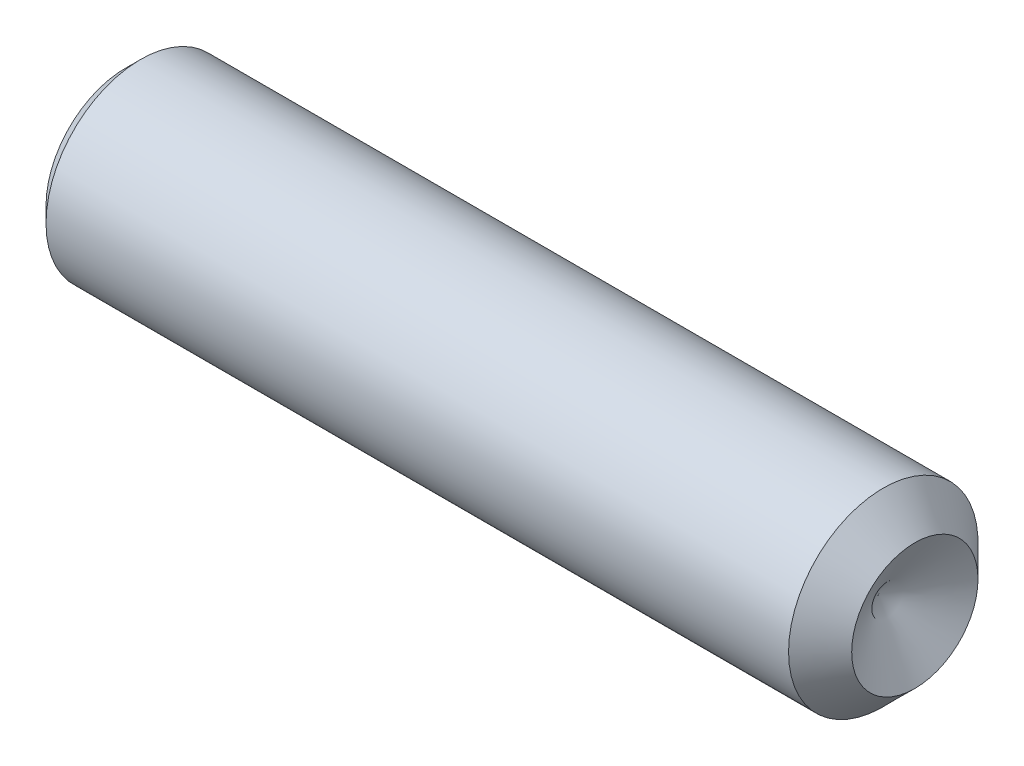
ISO-10303-21;
HEADER;
FILE_DESCRIPTION(('STEP AP214'),'2;1');
FILE_NAME('part.step','',(''),(''),'','','');
FILE_SCHEMA(('AUTOMOTIVE_DESIGN { 1 0 10303 214 1 1 1 1 }'));
ENDSEC;
DATA;
#1=APPLICATION_CONTEXT('core data for automotive mechanical design processes');
#2=APPLICATION_PROTOCOL_DEFINITION('international standard','automotive_design',2000,#1);
#3=PRODUCT_CONTEXT('',#1,'mechanical');
#4=PRODUCT('Part','Part','',(#3));
#5=PRODUCT_RELATED_PRODUCT_CATEGORY('part','',(#4));
#6=PRODUCT_DEFINITION_FORMATION('','',#4);
#7=PRODUCT_DEFINITION_CONTEXT('part definition',#1,'design');
#8=PRODUCT_DEFINITION('design','',#6,#7);
#9=PRODUCT_DEFINITION_SHAPE('','',#8);
#10=(LENGTH_UNIT() NAMED_UNIT(*) SI_UNIT(.MILLI.,.METRE.));
#11=(NAMED_UNIT(*) PLANE_ANGLE_UNIT() SI_UNIT($,.RADIAN.));
#12=(NAMED_UNIT(*) SI_UNIT($,.STERADIAN.) SOLID_ANGLE_UNIT());
#13=UNCERTAINTY_MEASURE_WITH_UNIT(LENGTH_MEASURE(1.E-05),#10,'distance_accuracy_value','');
#14=(GEOMETRIC_REPRESENTATION_CONTEXT(3) GLOBAL_UNCERTAINTY_ASSIGNED_CONTEXT((#13)) GLOBAL_UNIT_ASSIGNED_CONTEXT((#10,
#11,#12)) REPRESENTATION_CONTEXT('',''));
#15=CARTESIAN_POINT('',(0.,0.,0.));
#16=DIRECTION('',(0.,0.,1.));
#17=DIRECTION('',(1.,0.,0.));
#18=AXIS2_PLACEMENT_3D('',#15,#16,#17);
#19=CARTESIAN_POINT('',(0.,0.,0.));
#20=DIRECTION('',(1.,0.,0.));
#21=DIRECTION('',(0.,0.,-1.));
#22=AXIS2_PLACEMENT_3D('',#19,#20,#21);
#23=PLANE('',#22);
#24=CARTESIAN_POINT('',(0.,0.,0.));
#25=DIRECTION('',(-1.,0.,0.));
#26=DIRECTION('',(0.,0.,1.));
#27=AXIS2_PLACEMENT_3D('',#24,#25,#26);
#28=CIRCLE('',#27,5.036);
#29=CARTESIAN_POINT('',(0.,0.,5.036));
#30=VERTEX_POINT('',#29);
#31=EDGE_CURVE('E11',#30,#30,#28,.T.);
#32=ORIENTED_EDGE('',*,*,#31,.T.);
#33=EDGE_LOOP('',(#32));
#34=FACE_BOUND('',#33,.T.);
#35=DIRECTION('',(0.,0.5,0.866025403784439));
#36=VECTOR('',#35,1.);
#37=CARTESIAN_POINT('',(0.,1.73205080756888,-3.));
#38=LINE('',#37,#36);
#39=CARTESIAN_POINT('',(0.,1.73205080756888,-3.));
#40=VERTEX_POINT('',#39);
#41=CARTESIAN_POINT('',(0.,3.46410161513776,0.));
#42=VERTEX_POINT('',#41);
#43=EDGE_CURVE('E47',#40,#42,#38,.T.);
#44=ORIENTED_EDGE('',*,*,#43,.T.);
#45=DIRECTION('',(0.,-0.5,0.866025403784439));
#46=VECTOR('',#45,1.);
#47=CARTESIAN_POINT('',(0.,3.46410161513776,0.));
#48=LINE('',#47,#46);
#49=CARTESIAN_POINT('',(0.,1.73205080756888,3.));
#50=VERTEX_POINT('',#49);
#51=EDGE_CURVE('E105',#42,#50,#48,.T.);
#52=ORIENTED_EDGE('',*,*,#51,.T.);
#53=DIRECTION('',(0.,-1.,0.));
#54=VECTOR('',#53,1.);
#55=CARTESIAN_POINT('',(0.,1.73205080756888,3.));
#56=LINE('',#55,#54);
#57=CARTESIAN_POINT('',(0.,-1.73205080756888,3.));
#58=VERTEX_POINT('',#57);
#59=EDGE_CURVE('E154',#50,#58,#56,.T.);
#60=ORIENTED_EDGE('',*,*,#59,.T.);
#61=DIRECTION('',(0.,-0.5,-0.866025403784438));
#62=VECTOR('',#61,1.);
#63=CARTESIAN_POINT('',(0.,-1.73205080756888,3.));
#64=LINE('',#63,#62);
#65=CARTESIAN_POINT('',(0.,-3.46410161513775,0.));
#66=VERTEX_POINT('',#65);
#67=EDGE_CURVE('E161',#58,#66,#64,.T.);
#68=ORIENTED_EDGE('',*,*,#67,.T.);
#69=DIRECTION('',(0.,0.5,-0.866025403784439));
#70=VECTOR('',#69,1.);
#71=CARTESIAN_POINT('',(0.,-3.46410161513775,0.));
#72=LINE('',#71,#70);
#73=CARTESIAN_POINT('',(0.,-1.73205080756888,-3.));
#74=VERTEX_POINT('',#73);
#75=EDGE_CURVE('E164',#66,#74,#72,.T.);
#76=ORIENTED_EDGE('',*,*,#75,.T.);
#77=DIRECTION('',(0.,1.,0.));
#78=VECTOR('',#77,1.);
#79=CARTESIAN_POINT('',(0.,-1.73205080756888,-3.));
#80=LINE('',#79,#78);
#81=EDGE_CURVE('E101',#74,#40,#80,.T.);
#82=ORIENTED_EDGE('',*,*,#81,.T.);
#83=EDGE_LOOP('',(#44,#52,#60,#68,#76,#82));
#84=FACE_BOUND('',#83,.T.);
#85=ADVANCED_FACE('F33',(#34,#84),#23,.F.);
#86=CARTESIAN_POINT('',(0.964,0.,0.));
#87=DIRECTION('',(1.,0.,0.));
#88=DIRECTION('',(0.,0.,-1.));
#89=AXIS2_PLACEMENT_3D('',#86,#87,#88);
#90=CONICAL_SURFACE('',#89,6.,0.785398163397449);
#91=ORIENTED_EDGE('',*,*,#31,.F.);
#92=EDGE_LOOP('',(#91));
#93=FACE_BOUND('',#92,.T.);
#94=CARTESIAN_POINT('',(0.964,0.,0.));
#95=DIRECTION('',(-1.,0.,0.));
#96=DIRECTION('',(0.,0.,1.));
#97=AXIS2_PLACEMENT_3D('',#94,#95,#96);
#98=CIRCLE('',#97,6.);
#99=CARTESIAN_POINT('',(0.964,0.,6.));
#100=VERTEX_POINT('',#99);
#101=EDGE_CURVE('E40',#100,#100,#98,.T.);
#102=ORIENTED_EDGE('',*,*,#101,.T.);
#103=EDGE_LOOP('',(#102));
#104=FACE_BOUND('',#103,.T.);
#105=ADVANCED_FACE('F120',(#93,#104),#90,.T.);
#106=CARTESIAN_POINT('',(0.,0.,0.));
#107=DIRECTION('',(-1.,0.,0.));
#108=DIRECTION('',(0.,0.,1.));
#109=AXIS2_PLACEMENT_3D('',#106,#107,#108);
#110=CYLINDRICAL_SURFACE('',#109,6.);
#111=ORIENTED_EDGE('',*,*,#101,.F.);
#112=EDGE_LOOP('',(#111));
#113=FACE_BOUND('',#112,.T.);
#114=CARTESIAN_POINT('',(48.,0.,0.));
#115=DIRECTION('',(-1.,0.,0.));
#116=DIRECTION('',(0.,0.,1.));
#117=AXIS2_PLACEMENT_3D('',#114,#115,#116);
#118=CIRCLE('',#117,6.);
#119=CARTESIAN_POINT('',(48.,0.,6.));
#120=VERTEX_POINT('',#119);
#121=EDGE_CURVE('E110',#120,#120,#118,.T.);
#122=ORIENTED_EDGE('',*,*,#121,.T.);
#123=EDGE_LOOP('',(#122));
#124=FACE_BOUND('',#123,.T.);
#125=ADVANCED_FACE('F122',(#113,#124),#110,.T.);
#126=CARTESIAN_POINT('',(50.,0.,0.));
#127=DIRECTION('',(-1.,0.,0.));
#128=DIRECTION('',(0.,0.,1.));
#129=AXIS2_PLACEMENT_3D('',#126,#127,#128);
#130=CONICAL_SURFACE('',#129,4.,0.785398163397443);
#131=ORIENTED_EDGE('',*,*,#121,.F.);
#132=EDGE_LOOP('',(#131));
#133=FACE_BOUND('',#132,.T.);
#134=CARTESIAN_POINT('',(50.,0.,0.));
#135=DIRECTION('',(-1.,0.,0.));
#136=DIRECTION('',(0.,0.,1.));
#137=AXIS2_PLACEMENT_3D('',#134,#135,#136);
#138=CIRCLE('',#137,4.);
#139=CARTESIAN_POINT('',(50.,0.,4.));
#140=VERTEX_POINT('',#139);
#141=EDGE_CURVE('E106',#140,#140,#138,.T.);
#142=ORIENTED_EDGE('',*,*,#141,.T.);
#143=EDGE_LOOP('',(#142));
#144=FACE_BOUND('',#143,.T.);
#145=ADVANCED_FACE('F125',(#133,#144),#130,.T.);
#146=CARTESIAN_POINT('',(47.6905989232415,0.,0.));
#147=DIRECTION('',(1.,0.,0.));
#148=DIRECTION('',(0.,0.,-1.));
#149=AXIS2_PLACEMENT_3D('',#146,#147,#148);
#150=CONICAL_SURFACE('',#149,0.,1.0471975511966);
#151=ORIENTED_EDGE('',*,*,#141,.F.);
#152=EDGE_LOOP('',(#151));
#153=FACE_BOUND('',#152,.T.);
#154=CARTESIAN_POINT('',(47.6905989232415,0.,0.));
#155=VERTEX_POINT('',#154);
#156=VERTEX_LOOP('',#155);
#157=FACE_BOUND('',#156,.T.);
#158=ADVANCED_FACE('F131',(#153,#157),#150,.F.);
#159=CARTESIAN_POINT('',(8.,1.73205080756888,-3.));
#160=DIRECTION('',(0.,-0.866025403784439,0.5));
#161=DIRECTION('',(0.,-0.5,-0.866025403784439));
#162=AXIS2_PLACEMENT_3D('',#159,#160,#161);
#163=PLANE('',#162);
#164=ORIENTED_EDGE('',*,*,#43,.F.);
#165=DIRECTION('',(-1.,0.,0.));
#166=VECTOR('',#165,1.);
#167=CARTESIAN_POINT('',(8.,1.73205080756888,-3.));
#168=LINE('',#167,#166);
#169=CARTESIAN_POINT('',(8.,1.73205080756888,-3.));
#170=VERTEX_POINT('',#169);
#171=EDGE_CURVE('E100',#170,#40,#168,.T.);
#172=ORIENTED_EDGE('',*,*,#171,.F.);
#173=DIRECTION('',(0.,0.5,0.866025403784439));
#174=VECTOR('',#173,1.);
#175=CARTESIAN_POINT('',(8.,1.73205080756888,-3.));
#176=LINE('',#175,#174);
#177=CARTESIAN_POINT('',(8.,3.46410161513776,0.));
#178=VERTEX_POINT('',#177);
#179=EDGE_CURVE('E91',#170,#178,#176,.T.);
#180=ORIENTED_EDGE('',*,*,#179,.T.);
#181=DIRECTION('',(-1.,0.,0.));
#182=VECTOR('',#181,1.);
#183=CARTESIAN_POINT('',(8.,3.46410161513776,0.));
#184=LINE('',#183,#182);
#185=EDGE_CURVE('E99',#178,#42,#184,.T.);
#186=ORIENTED_EDGE('',*,*,#185,.T.);
#187=EDGE_LOOP('',(#164,#172,#180,#186));
#188=FACE_BOUND('',#187,.T.);
#189=ADVANCED_FACE('F98',(#188),#163,.T.);
#190=CARTESIAN_POINT('',(8.,3.46410161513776,0.));
#191=DIRECTION('',(0.,-0.866025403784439,-0.5));
#192=DIRECTION('',(0.,0.5,-0.866025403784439));
#193=AXIS2_PLACEMENT_3D('',#190,#191,#192);
#194=PLANE('',#193);
#195=ORIENTED_EDGE('',*,*,#51,.F.);
#196=ORIENTED_EDGE('',*,*,#185,.F.);
#197=DIRECTION('',(0.,-0.5,0.866025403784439));
#198=VECTOR('',#197,1.);
#199=CARTESIAN_POINT('',(8.,3.46410161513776,0.));
#200=LINE('',#199,#198);
#201=CARTESIAN_POINT('',(8.,1.73205080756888,3.));
#202=VERTEX_POINT('',#201);
#203=EDGE_CURVE('E87',#178,#202,#200,.T.);
#204=ORIENTED_EDGE('',*,*,#203,.T.);
#205=DIRECTION('',(-1.,0.,0.));
#206=VECTOR('',#205,1.);
#207=CARTESIAN_POINT('',(8.,1.73205080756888,3.));
#208=LINE('',#207,#206);
#209=EDGE_CURVE('E107',#202,#50,#208,.T.);
#210=ORIENTED_EDGE('',*,*,#209,.T.);
#211=EDGE_LOOP('',(#195,#196,#204,#210));
#212=FACE_BOUND('',#211,.T.);
#213=ADVANCED_FACE('F103',(#212),#194,.T.);
#214=CARTESIAN_POINT('',(8.,1.73205080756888,3.));
#215=DIRECTION('',(0.,0.,-1.));
#216=DIRECTION('',(-1.,0.,0.));
#217=AXIS2_PLACEMENT_3D('',#214,#215,#216);
#218=PLANE('',#217);
#219=ORIENTED_EDGE('',*,*,#59,.F.);
#220=ORIENTED_EDGE('',*,*,#209,.F.);
#221=DIRECTION('',(0.,-1.,0.));
#222=VECTOR('',#221,1.);
#223=CARTESIAN_POINT('',(8.,1.73205080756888,3.));
#224=LINE('',#223,#222);
#225=CARTESIAN_POINT('',(8.,-1.73205080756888,3.));
#226=VERTEX_POINT('',#225);
#227=EDGE_CURVE('E93',#202,#226,#224,.T.);
#228=ORIENTED_EDGE('',*,*,#227,.T.);
#229=DIRECTION('',(-1.,0.,0.));
#230=VECTOR('',#229,1.);
#231=CARTESIAN_POINT('',(8.,-1.73205080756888,3.));
#232=LINE('',#231,#230);
#233=EDGE_CURVE('E112',#226,#58,#232,.T.);
#234=ORIENTED_EDGE('',*,*,#233,.T.);
#235=EDGE_LOOP('',(#219,#220,#228,#234));
#236=FACE_BOUND('',#235,.T.);
#237=ADVANCED_FACE('F175',(#236),#218,.T.);
#238=CARTESIAN_POINT('',(8.,-1.73205080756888,3.));
#239=DIRECTION('',(0.,0.866025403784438,-0.5));
#240=DIRECTION('',(0.,0.5,0.866025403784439));
#241=AXIS2_PLACEMENT_3D('',#238,#239,#240);
#242=PLANE('',#241);
#243=ORIENTED_EDGE('',*,*,#67,.F.);
#244=ORIENTED_EDGE('',*,*,#233,.F.);
#245=DIRECTION('',(0.,-0.5,-0.866025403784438));
#246=VECTOR('',#245,1.);
#247=CARTESIAN_POINT('',(8.,-1.73205080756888,3.));
#248=LINE('',#247,#246);
#249=CARTESIAN_POINT('',(8.,-3.46410161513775,0.));
#250=VERTEX_POINT('',#249);
#251=EDGE_CURVE('E187',#226,#250,#248,.T.);
#252=ORIENTED_EDGE('',*,*,#251,.T.);
#253=DIRECTION('',(-1.,0.,0.));
#254=VECTOR('',#253,1.);
#255=CARTESIAN_POINT('',(8.,-3.46410161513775,0.));
#256=LINE('',#255,#254);
#257=EDGE_CURVE('E170',#250,#66,#256,.T.);
#258=ORIENTED_EDGE('',*,*,#257,.T.);
#259=EDGE_LOOP('',(#243,#244,#252,#258));
#260=FACE_BOUND('',#259,.T.);
#261=ADVANCED_FACE('F177',(#260),#242,.T.);
#262=CARTESIAN_POINT('',(8.,-3.46410161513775,0.));
#263=DIRECTION('',(0.,0.866025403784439,0.5));
#264=DIRECTION('',(0.,-0.5,0.866025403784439));
#265=AXIS2_PLACEMENT_3D('',#262,#263,#264);
#266=PLANE('',#265);
#267=ORIENTED_EDGE('',*,*,#75,.F.);
#268=ORIENTED_EDGE('',*,*,#257,.F.);
#269=DIRECTION('',(0.,0.5,-0.866025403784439));
#270=VECTOR('',#269,1.);
#271=CARTESIAN_POINT('',(8.,-3.46410161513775,0.));
#272=LINE('',#271,#270);
#273=CARTESIAN_POINT('',(8.,-1.73205080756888,-3.));
#274=VERTEX_POINT('',#273);
#275=EDGE_CURVE('E184',#250,#274,#272,.T.);
#276=ORIENTED_EDGE('',*,*,#275,.T.);
#277=DIRECTION('',(-1.,0.,0.));
#278=VECTOR('',#277,1.);
#279=CARTESIAN_POINT('',(8.,-1.73205080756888,-3.));
#280=LINE('',#279,#278);
#281=EDGE_CURVE('E168',#274,#74,#280,.T.);
#282=ORIENTED_EDGE('',*,*,#281,.T.);
#283=EDGE_LOOP('',(#267,#268,#276,#282));
#284=FACE_BOUND('',#283,.T.);
#285=ADVANCED_FACE('F181',(#284),#266,.T.);
#286=CARTESIAN_POINT('',(8.,-1.73205080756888,-3.));
#287=DIRECTION('',(0.,0.,1.));
#288=DIRECTION('',(1.,0.,0.));
#289=AXIS2_PLACEMENT_3D('',#286,#287,#288);
#290=PLANE('',#289);
#291=ORIENTED_EDGE('',*,*,#81,.F.);
#292=ORIENTED_EDGE('',*,*,#281,.F.);
#293=DIRECTION('',(0.,1.,0.));
#294=VECTOR('',#293,1.);
#295=CARTESIAN_POINT('',(8.,-1.73205080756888,-3.));
#296=LINE('',#295,#294);
#297=EDGE_CURVE('E157',#274,#170,#296,.T.);
#298=ORIENTED_EDGE('',*,*,#297,.T.);
#299=ORIENTED_EDGE('',*,*,#171,.T.);
#300=EDGE_LOOP('',(#291,#292,#298,#299));
#301=FACE_BOUND('',#300,.T.);
#302=ADVANCED_FACE('F186',(#301),#290,.T.);
#303=CARTESIAN_POINT('',(8.,5.19615242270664,3.));
#304=DIRECTION('',(1.,0.,0.));
#305=DIRECTION('',(0.,0.,-1.));
#306=AXIS2_PLACEMENT_3D('',#303,#304,#305);
#307=PLANE('',#306);
#308=ORIENTED_EDGE('',*,*,#179,.F.);
#309=ORIENTED_EDGE('',*,*,#297,.F.);
#310=ORIENTED_EDGE('',*,*,#275,.F.);
#311=ORIENTED_EDGE('',*,*,#251,.F.);
#312=ORIENTED_EDGE('',*,*,#227,.F.);
#313=ORIENTED_EDGE('',*,*,#203,.F.);
#314=EDGE_LOOP('',(#308,#309,#310,#311,#312,#313));
#315=FACE_BOUND('',#314,.T.);
#316=ADVANCED_FACE('F89',(#315),#307,.F.);
#317=CLOSED_SHELL('',(#85,#105,#125,#145,#158,#189,#213,#237,#261,#285,#302,#316));
#318=MANIFOLD_SOLID_BREP('B2',#317);
#319=ADVANCED_BREP_SHAPE_REPRESENTATION('',(#18,#318),#14);
#320=SHAPE_DEFINITION_REPRESENTATION(#9,#319);
ENDSEC;
END-ISO-10303-21;
